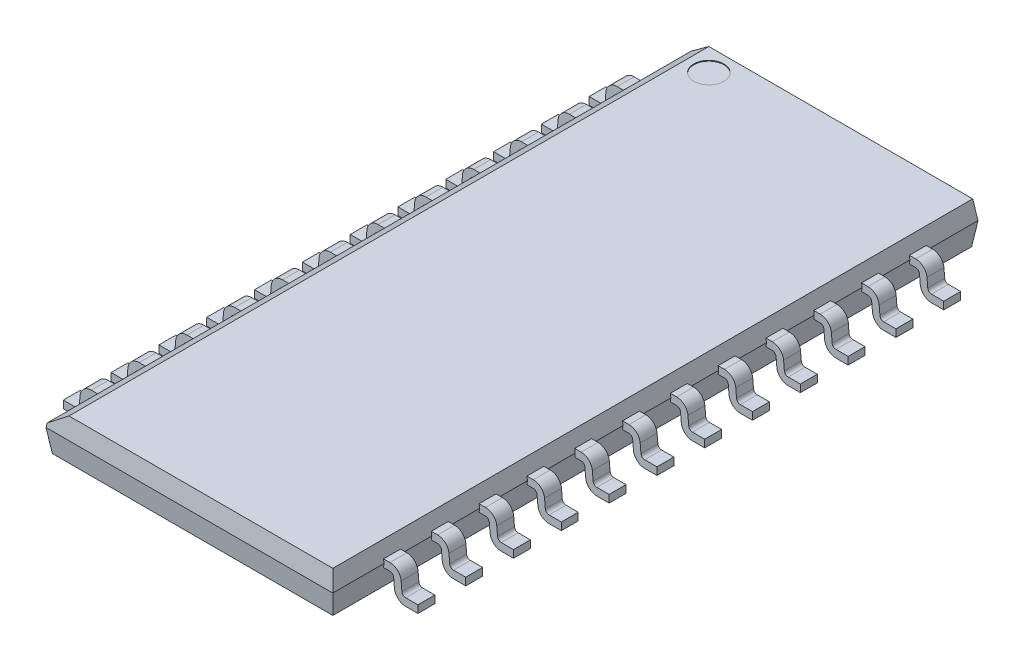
from build123d import *

# Parameters (mm, degrees)
EXTRUDE_1_DEPTH              = 0.225
SKETCH_8395_W                = 7.62
SKETCH_8395_H                = 17.14
EXTRUDE_8453_DEPTH           = 0.5
EXTRUDE_8453_TAPER           = 8
EXTRUDE_8453_OTHER_WAY_DEPTH = 0.6
EXTRUDE_8453_OTHER_WAY_TAPER = 8
PATTERN_LINEAR_8532_COUNT    = 12
PATTERN_LINEAR_8532_PITCH    = 1.27
CHAMFER_1_SIZE               = 0.4
CHAMFER_1_SIZE2              = 0.469982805
SKETCH_3_R                   = 0.4
CUT_EXTRUDE_3_DEPTH          = 0.02


with BuildPart() as part:
    # Sketch 1 → Extrude 1 (new, symmetric)
    with BuildSketch(Plane.XY.offset(-6.985)):
        with BuildLine():
            Line((-4.71, 0), (-4.384899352, 0))
            ThreePointArc((-4.384899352, 0), (-4.18222229, 0.078816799), (-4.086040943, 0.273853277))
            Line((-4.086040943, 0.273853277), (-4.065493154, 0.508715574))
            ThreePointArc((-4.065493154, 0.508715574), (-4.033432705, 0.573727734), (-3.965873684, 0.6))
            Line((-3.965873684, 0.6), (3.965873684, 0.6))
            ThreePointArc((3.965873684, 0.6), (4.033432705, 0.573727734), (4.065493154, 0.508715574))
            Line((4.065493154, 0.508715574), (4.086040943, 0.273853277))
            ThreePointArc((4.086040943, 0.273853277), (4.18222229, 0.078816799), (4.384899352, 0))
            Line((4.384899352, 0), (4.71, 0))
            Line((4.71, 0), (4.71, 0.2))
            Line((4.71, 0.2), (4.384899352, 0.2))
            ThreePointArc((4.384899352, 0.2), (4.317340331, 0.226272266), (4.285279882, 0.291284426))
            Line((4.285279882, 0.291284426), (4.264732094, 0.526146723))
            ThreePointArc((4.264732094, 0.526146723), (4.168550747, 0.721183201), (3.965873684, 0.8))
            Line((3.965873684, 0.8), (-3.965873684, 0.8))
            ThreePointArc((-3.965873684, 0.8), (-4.168550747, 0.721183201), (-4.264732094, 0.526146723))
            Line((-4.264732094, 0.526146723), (-4.285279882, 0.291284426))
            ThreePointArc((-4.285279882, 0.291284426), (-4.317340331, 0.226272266), (-4.384899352, 0.2))
            Line((-4.384899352, 0.2), (-4.71, 0.2))
            Line((-4.71, 0.2), (-4.71, 0))
        make_face()
    extrude_1 = extrude(amount=EXTRUDE_1_DEPTH, both=True)

    # Sketch 8395 → Extrude 8453 (add)
    with BuildSketch(Plane(origin=(0, 0.7, 0), x_dir=(1, 0, 0), z_dir=(0, 1, 0))):
        Rectangle(SKETCH_8395_W, SKETCH_8395_H)
    extrude(amount=EXTRUDE_8453_DEPTH, taper=EXTRUDE_8453_TAPER)

    # Sketch 8395 → Extrude 8453 other way (add)
    with BuildSketch(Plane(origin=(0, 0.7, 0), x_dir=(1, 0, 0), z_dir=(0, 1, 0))):
        Rectangle(SKETCH_8395_W, SKETCH_8395_H)
    extrude(amount=-EXTRUDE_8453_OTHER_WAY_DEPTH, taper=EXTRUDE_8453_OTHER_WAY_TAPER)

    # Pattern Linear 8532: Extrude 1 ×12
    with Locations(*[(0, 0, i * PATTERN_LINEAR_8532_PITCH) for i in range(1, PATTERN_LINEAR_8532_COUNT)]):
        add(extrude_1)

    # Chamfer 1
    chamfer_1_edges = [part.edges().sort_by_distance(p)[0] for p in [
        (-3.739729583, 1.2, 0),
    ]]
    chamfer_1_side = [part.faces().sort_by_distance(p)[0] for p in [
        (-3.773017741, 0.963142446, 0),
    ]]
    chamfer(chamfer_1_edges, length=CHAMFER_1_SIZE, length2=CHAMFER_1_SIZE2, reference=chamfer_1_side[0])

    # Sketch 3 → Cut-Extrude 3 (cut)
    with BuildSketch(Plane(origin=(0, 1.2, 0), x_dir=(1, 0, 0), z_dir=(0, 1, 0))):
        with Locations(Location((-2.669746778, 7.899729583, 0), (0, 0, 270))):
            Circle(SKETCH_3_R)
    extrude(amount=-CUT_EXTRUDE_3_DEPTH, mode=Mode.SUBTRACT)


solid = part.part
